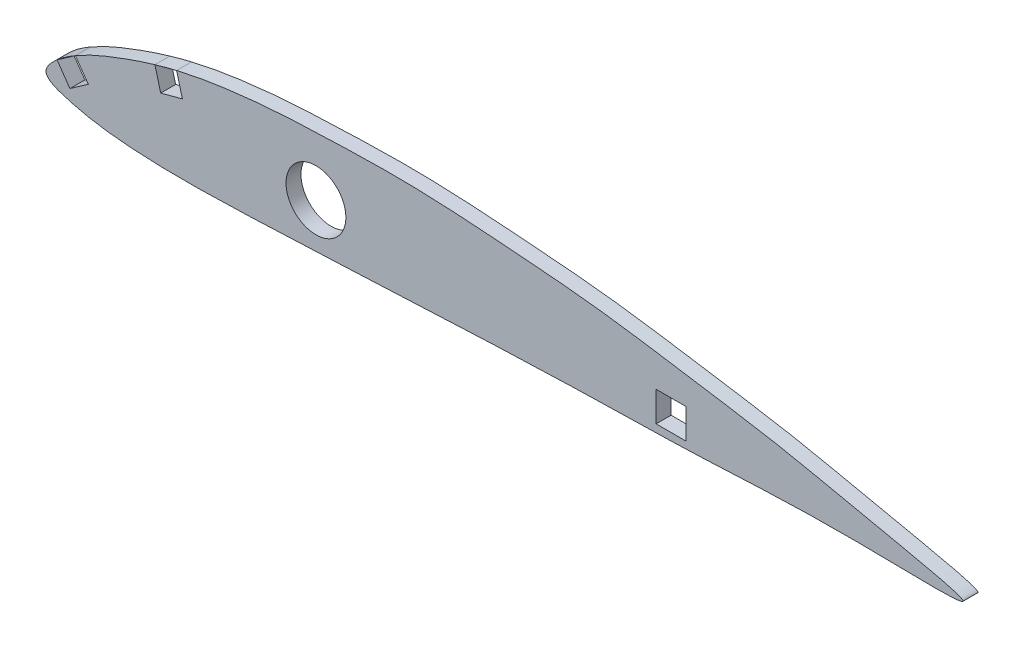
from build123d import *

# Parameters (mm, degrees)
BOSS_EXTRUDE1_DEPTH = 3.175
SKETCH1_R           = 6.35
SKETCH1_W           = 6.35
SKETCH1_H           = 6.35
CUT_EXTRUDE1_DEPTH  = 10


with BuildPart() as part:
    # 3DSketch1 → Boss-Extrude1 (new body)
    with BuildSketch(Plane(origin=(0, 0, 0), x_dir=(0.999981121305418, -0.006144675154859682, 0), z_dir=(0, 0, 1))):
        with BuildLine():
            add(Edge.make_bspline(
                [(0, 0), (-0.059984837, 1.04036125), (2.19812418, 3.390480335), (5.411520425, 5.721945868), (9.580889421, 8.000271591), (17.571867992, 11.308145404), (27.270635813, 14.468373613), (38.76248152, 16.378614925), (48.506089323, 17.411500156), (61.480401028, 18.035139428), (77.715965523, 18.59548821), (97.1594056, 17.350877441), (116.74415641, 15.945852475), (135.894184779, 12.998738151), (156.436063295, 9.987442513), (172.120798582, 6.399095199), (205.50092535, 0), (162.353626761, 1.254348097), (143.604496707, -0.577735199), (103.111329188, -1.464972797), (71.465489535, -3.384418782), (38.881102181, -5.005399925), (22.864940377, -5.366472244), (11.068063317, -4.297034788), (5.057589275, -2.96155364), (0.082314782, -1.42764595), (0, 0)],
                knots=[0, 0, 0, 0, 0.010560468, 0.018211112, 0.032209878, 0.045524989, 0.084069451, 0.108974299, 0.133649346, 0.158232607, 0.207343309, 0.256522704, 0.305826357, 0.355445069, 0.405214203, 0.45539047, 0.506006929, 0.555121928, 0.653369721, 0.702490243, 0.849938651, 0.899083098, 0.948194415, 0.97290595, 0.985508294, 1, 1, 1, 1], degree=3))
        make_face()
    extrude(amount=BOSS_EXTRUDE1_DEPTH)

    # Sketch1 → Cut-Extrude1 (cut)
    with BuildSketch(Plane.XY.offset(3.175)):
        with Locations((57.26, 5)):
            Circle(SKETCH1_R)
        Polygon((2.344270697, 3.3283155), (6.245482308, 6.059973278), (8.977140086, 2.158761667), (5.075928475, -0.572896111), align=None)
        with Locations((132.592, 3.175)):
            Rectangle(SKETCH1_W, SKETCH1_H)
        Polygon((23.099964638, 12.82099893), (27.700186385, 14.053624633), (28.932812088, 9.453402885), (24.33259034, 8.220777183), align=None)
    extrude(amount=-CUT_EXTRUDE1_DEPTH, mode=Mode.SUBTRACT)


solid = part.part
